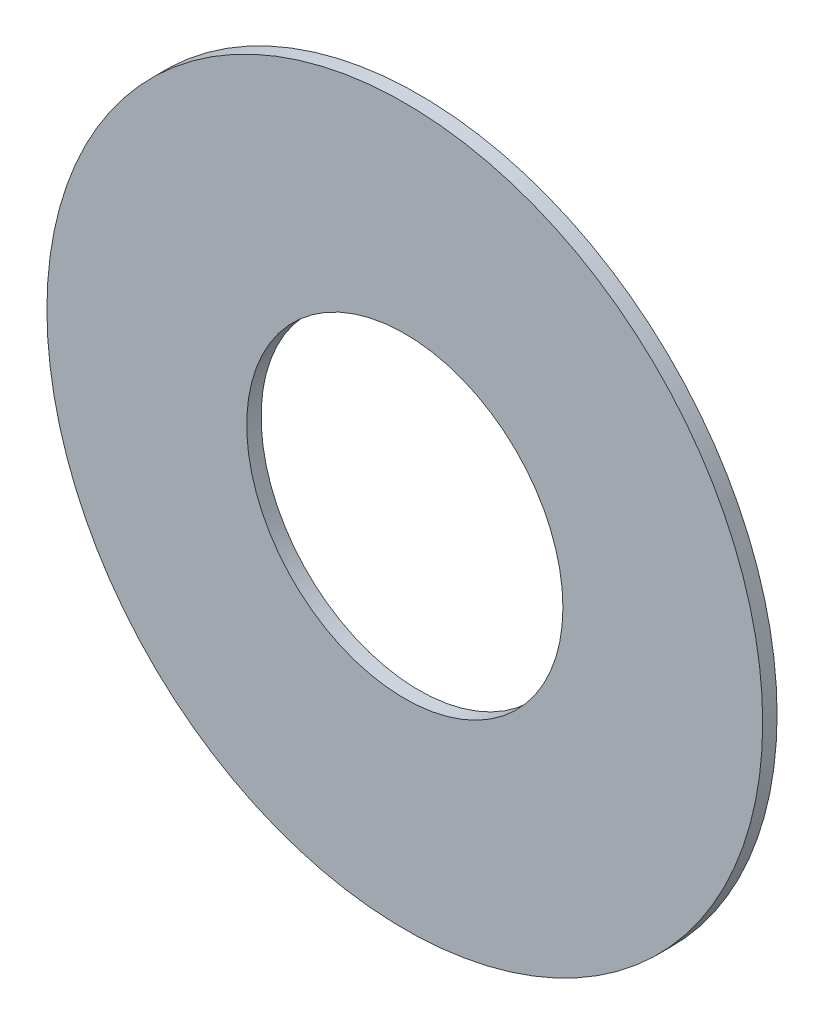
ISO-10303-21;
HEADER;
FILE_DESCRIPTION(('STEP AP214'),'2;1');
FILE_NAME('part.step','',(''),(''),'','','');
FILE_SCHEMA(('AUTOMOTIVE_DESIGN { 1 0 10303 214 1 1 1 1 }'));
ENDSEC;
DATA;
#1=APPLICATION_CONTEXT('core data for automotive mechanical design processes');
#2=APPLICATION_PROTOCOL_DEFINITION('international standard','automotive_design',2000,#1);
#3=PRODUCT_CONTEXT('',#1,'mechanical');
#4=PRODUCT('Part','Part','',(#3));
#5=PRODUCT_RELATED_PRODUCT_CATEGORY('part','',(#4));
#6=PRODUCT_DEFINITION_FORMATION('','',#4);
#7=PRODUCT_DEFINITION_CONTEXT('part definition',#1,'design');
#8=PRODUCT_DEFINITION('design','',#6,#7);
#9=PRODUCT_DEFINITION_SHAPE('','',#8);
#10=(LENGTH_UNIT() NAMED_UNIT(*) SI_UNIT(.MILLI.,.METRE.));
#11=(NAMED_UNIT(*) PLANE_ANGLE_UNIT() SI_UNIT($,.RADIAN.));
#12=(NAMED_UNIT(*) SI_UNIT($,.STERADIAN.) SOLID_ANGLE_UNIT());
#13=UNCERTAINTY_MEASURE_WITH_UNIT(LENGTH_MEASURE(1.E-05),#10,'distance_accuracy_value','');
#14=(GEOMETRIC_REPRESENTATION_CONTEXT(3) GLOBAL_UNCERTAINTY_ASSIGNED_CONTEXT((#13)) GLOBAL_UNIT_ASSIGNED_CONTEXT((#10,
#11,#12)) REPRESENTATION_CONTEXT('',''));
#15=CARTESIAN_POINT('',(0.,0.,0.));
#16=DIRECTION('',(0.,0.,1.));
#17=DIRECTION('',(1.,0.,0.));
#18=AXIS2_PLACEMENT_3D('',#15,#16,#17);
#19=CARTESIAN_POINT('',(0.,0.,0.5));
#20=DIRECTION('',(0.,0.,1.));
#21=DIRECTION('',(1.,0.,0.));
#22=AXIS2_PLACEMENT_3D('',#19,#20,#21);
#23=PLANE('',#22);
#24=CARTESIAN_POINT('',(0.,0.,0.5));
#25=DIRECTION('',(0.,0.,1.));
#26=DIRECTION('',(1.,0.,0.));
#27=AXIS2_PLACEMENT_3D('',#24,#25,#26);
#28=CIRCLE('',#27,12.45);
#29=CARTESIAN_POINT('',(12.45,0.,0.5));
#30=VERTEX_POINT('',#29);
#31=EDGE_CURVE('E10',#30,#30,#28,.T.);
#32=ORIENTED_EDGE('',*,*,#31,.T.);
#33=EDGE_LOOP('',(#32));
#34=FACE_BOUND('',#33,.T.);
#35=CARTESIAN_POINT('',(0.,0.,0.5));
#36=DIRECTION('',(0.,0.,1.));
#37=DIRECTION('',(1.,0.,0.));
#38=AXIS2_PLACEMENT_3D('',#35,#36,#37);
#39=CIRCLE('',#38,5.5);
#40=CARTESIAN_POINT('',(5.5,0.,0.5));
#41=VERTEX_POINT('',#40);
#42=EDGE_CURVE('E41',#41,#41,#39,.T.);
#43=ORIENTED_EDGE('',*,*,#42,.F.);
#44=EDGE_LOOP('',(#43));
#45=FACE_BOUND('',#44,.T.);
#46=ADVANCED_FACE('F30',(#34,#45),#23,.T.);
#47=CARTESIAN_POINT('',(0.,0.,0.));
#48=DIRECTION('',(0.,0.,1.));
#49=DIRECTION('',(1.,0.,0.));
#50=AXIS2_PLACEMENT_3D('',#47,#48,#49);
#51=PLANE('',#50);
#52=CARTESIAN_POINT('',(0.,0.,0.));
#53=DIRECTION('',(0.,0.,1.));
#54=DIRECTION('',(1.,0.,0.));
#55=AXIS2_PLACEMENT_3D('',#52,#53,#54);
#56=CIRCLE('',#55,12.45);
#57=CARTESIAN_POINT('',(12.45,0.,0.));
#58=VERTEX_POINT('',#57);
#59=EDGE_CURVE('E37',#58,#58,#56,.T.);
#60=ORIENTED_EDGE('',*,*,#59,.F.);
#61=EDGE_LOOP('',(#60));
#62=FACE_BOUND('',#61,.T.);
#63=CARTESIAN_POINT('',(0.,0.,0.));
#64=DIRECTION('',(0.,0.,1.));
#65=DIRECTION('',(1.,0.,0.));
#66=AXIS2_PLACEMENT_3D('',#63,#64,#65);
#67=CIRCLE('',#66,5.5);
#68=CARTESIAN_POINT('',(5.5,0.,0.));
#69=VERTEX_POINT('',#68);
#70=EDGE_CURVE('E45',#69,#69,#67,.T.);
#71=ORIENTED_EDGE('',*,*,#70,.T.);
#72=EDGE_LOOP('',(#71));
#73=FACE_BOUND('',#72,.T.);
#74=ADVANCED_FACE('F51',(#62,#73),#51,.F.);
#75=CARTESIAN_POINT('',(0.,0.,0.5));
#76=DIRECTION('',(0.,0.,-1.));
#77=DIRECTION('',(-1.,0.,0.));
#78=AXIS2_PLACEMENT_3D('',#75,#76,#77);
#79=CYLINDRICAL_SURFACE('',#78,12.45);
#80=ORIENTED_EDGE('',*,*,#31,.F.);
#81=EDGE_LOOP('',(#80));
#82=FACE_BOUND('',#81,.T.);
#83=ORIENTED_EDGE('',*,*,#59,.T.);
#84=EDGE_LOOP('',(#83));
#85=FACE_BOUND('',#84,.T.);
#86=ADVANCED_FACE('F32',(#82,#85),#79,.T.);
#87=CARTESIAN_POINT('',(0.,0.,0.5));
#88=DIRECTION('',(0.,0.,-1.));
#89=DIRECTION('',(-1.,0.,0.));
#90=AXIS2_PLACEMENT_3D('',#87,#88,#89);
#91=CYLINDRICAL_SURFACE('',#90,5.5);
#92=ORIENTED_EDGE('',*,*,#42,.T.);
#93=EDGE_LOOP('',(#92));
#94=FACE_BOUND('',#93,.T.);
#95=ORIENTED_EDGE('',*,*,#70,.F.);
#96=EDGE_LOOP('',(#95));
#97=FACE_BOUND('',#96,.T.);
#98=ADVANCED_FACE('F53',(#94,#97),#91,.F.);
#99=CLOSED_SHELL('',(#46,#74,#86,#98));
#100=MANIFOLD_SOLID_BREP('B2',#99);
#101=ADVANCED_BREP_SHAPE_REPRESENTATION('',(#18,#100),#14);
#102=SHAPE_DEFINITION_REPRESENTATION(#9,#101);
ENDSEC;
END-ISO-10303-21;
